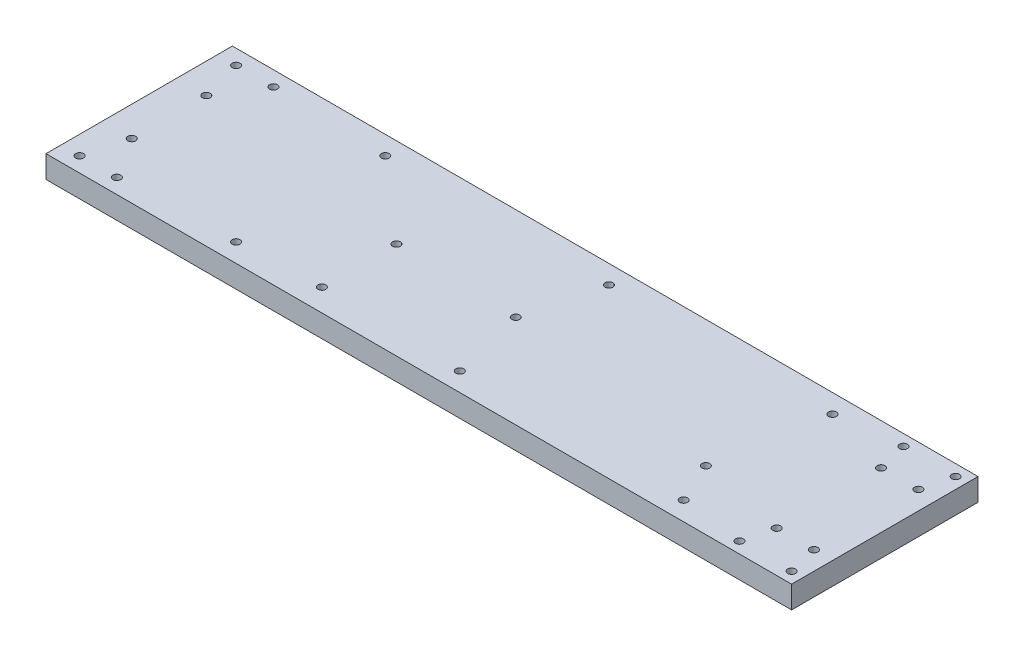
ISO-10303-21;
HEADER;
FILE_DESCRIPTION(('STEP AP214'),'2;1');
FILE_NAME('part.step','',(''),(''),'','','');
FILE_SCHEMA(('AUTOMOTIVE_DESIGN { 1 0 10303 214 1 1 1 1 }'));
ENDSEC;
DATA;
#1=APPLICATION_CONTEXT('core data for automotive mechanical design processes');
#2=APPLICATION_PROTOCOL_DEFINITION('international standard','automotive_design',2000,#1);
#3=PRODUCT_CONTEXT('',#1,'mechanical');
#4=PRODUCT('Part','Part','',(#3));
#5=PRODUCT_RELATED_PRODUCT_CATEGORY('part','',(#4));
#6=PRODUCT_DEFINITION_FORMATION('','',#4);
#7=PRODUCT_DEFINITION_CONTEXT('part definition',#1,'design');
#8=PRODUCT_DEFINITION('design','',#6,#7);
#9=PRODUCT_DEFINITION_SHAPE('','',#8);
#10=(LENGTH_UNIT() NAMED_UNIT(*) SI_UNIT(.MILLI.,.METRE.));
#11=(NAMED_UNIT(*) PLANE_ANGLE_UNIT() SI_UNIT($,.RADIAN.));
#12=(NAMED_UNIT(*) SI_UNIT($,.STERADIAN.) SOLID_ANGLE_UNIT());
#13=UNCERTAINTY_MEASURE_WITH_UNIT(LENGTH_MEASURE(1.E-05),#10,'distance_accuracy_value','');
#14=(GEOMETRIC_REPRESENTATION_CONTEXT(3) GLOBAL_UNCERTAINTY_ASSIGNED_CONTEXT((#13)) GLOBAL_UNIT_ASSIGNED_CONTEXT((#10,
#11,#12)) REPRESENTATION_CONTEXT('',''));
#15=CARTESIAN_POINT('',(0.,0.,0.));
#16=DIRECTION('',(0.,0.,1.));
#17=DIRECTION('',(1.,0.,0.));
#18=AXIS2_PLACEMENT_3D('',#15,#16,#17);
#19=CARTESIAN_POINT('',(200.,-6.,25.));
#20=DIRECTION('',(1.,0.,0.));
#21=DIRECTION('',(0.,0.,-1.));
#22=AXIS2_PLACEMENT_3D('',#19,#20,#21);
#23=PLANE('',#22);
#24=DIRECTION('',(0.,0.,-1.));
#25=VECTOR('',#24,1.);
#26=CARTESIAN_POINT('',(200.,0.,25.));
#27=LINE('',#26,#25);
#28=CARTESIAN_POINT('',(200.,0.,25.));
#29=VERTEX_POINT('',#28);
#30=CARTESIAN_POINT('',(200.,0.,-25.));
#31=VERTEX_POINT('',#30);
#32=EDGE_CURVE('E66',#29,#31,#27,.T.);
#33=ORIENTED_EDGE('',*,*,#32,.F.);
#34=DIRECTION('',(0.,1.,0.));
#35=VECTOR('',#34,1.);
#36=CARTESIAN_POINT('',(200.,-6.,25.));
#37=LINE('',#36,#35);
#38=CARTESIAN_POINT('',(200.,-6.,25.));
#39=VERTEX_POINT('',#38);
#40=EDGE_CURVE('E11',#39,#29,#37,.T.);
#41=ORIENTED_EDGE('',*,*,#40,.F.);
#42=DIRECTION('',(0.,0.,-1.));
#43=VECTOR('',#42,1.);
#44=CARTESIAN_POINT('',(200.,-6.,25.));
#45=LINE('',#44,#43);
#46=CARTESIAN_POINT('',(200.,-6.,-25.));
#47=VERTEX_POINT('',#46);
#48=EDGE_CURVE('E68',#39,#47,#45,.T.);
#49=ORIENTED_EDGE('',*,*,#48,.T.);
#50=DIRECTION('',(0.,1.,0.));
#51=VECTOR('',#50,1.);
#52=CARTESIAN_POINT('',(200.,-6.,-25.));
#53=LINE('',#52,#51);
#54=EDGE_CURVE('E29',#47,#31,#53,.T.);
#55=ORIENTED_EDGE('',*,*,#54,.T.);
#56=EDGE_LOOP('',(#33,#41,#49,#55));
#57=FACE_BOUND('',#56,.T.);
#58=ADVANCED_FACE('F26',(#57),#23,.T.);
#59=CARTESIAN_POINT('',(200.,-6.,25.));
#60=DIRECTION('',(0.,0.,1.));
#61=DIRECTION('',(1.,0.,0.));
#62=AXIS2_PLACEMENT_3D('',#59,#60,#61);
#63=PLANE('',#62);
#64=DIRECTION('',(1.,0.,0.));
#65=VECTOR('',#64,1.);
#66=CARTESIAN_POINT('',(200.,0.,25.));
#67=LINE('',#66,#65);
#68=CARTESIAN_POINT('',(0.,0.,25.));
#69=VERTEX_POINT('',#68);
#70=EDGE_CURVE('E83',#69,#29,#67,.T.);
#71=ORIENTED_EDGE('',*,*,#70,.F.);
#72=DIRECTION('',(0.,1.,0.));
#73=VECTOR('',#72,1.);
#74=CARTESIAN_POINT('',(0.,-6.,25.));
#75=LINE('',#74,#73);
#76=CARTESIAN_POINT('',(0.,-6.,25.));
#77=VERTEX_POINT('',#76);
#78=EDGE_CURVE('E34',#77,#69,#75,.T.);
#79=ORIENTED_EDGE('',*,*,#78,.F.);
#80=DIRECTION('',(1.,0.,0.));
#81=VECTOR('',#80,1.);
#82=CARTESIAN_POINT('',(200.,-6.,25.));
#83=LINE('',#82,#81);
#84=EDGE_CURVE('E73',#77,#39,#83,.T.);
#85=ORIENTED_EDGE('',*,*,#84,.T.);
#86=ORIENTED_EDGE('',*,*,#40,.T.);
#87=EDGE_LOOP('',(#71,#79,#85,#86));
#88=FACE_BOUND('',#87,.T.);
#89=ADVANCED_FACE('F103',(#88),#63,.T.);
#90=CARTESIAN_POINT('',(0.,-6.,25.));
#91=DIRECTION('',(-1.,0.,0.));
#92=DIRECTION('',(0.,0.,1.));
#93=AXIS2_PLACEMENT_3D('',#90,#91,#92);
#94=PLANE('',#93);
#95=DIRECTION('',(0.,0.,1.));
#96=VECTOR('',#95,1.);
#97=CARTESIAN_POINT('',(0.,0.,25.));
#98=LINE('',#97,#96);
#99=CARTESIAN_POINT('',(0.,0.,-25.));
#100=VERTEX_POINT('',#99);
#101=EDGE_CURVE('E80',#100,#69,#98,.T.);
#102=ORIENTED_EDGE('',*,*,#101,.F.);
#103=DIRECTION('',(0.,1.,0.));
#104=VECTOR('',#103,1.);
#105=CARTESIAN_POINT('',(0.,-6.,-25.));
#106=LINE('',#105,#104);
#107=CARTESIAN_POINT('',(0.,-6.,-25.));
#108=VERTEX_POINT('',#107);
#109=EDGE_CURVE('E72',#108,#100,#106,.T.);
#110=ORIENTED_EDGE('',*,*,#109,.F.);
#111=DIRECTION('',(0.,0.,1.));
#112=VECTOR('',#111,1.);
#113=CARTESIAN_POINT('',(0.,-6.,25.));
#114=LINE('',#113,#112);
#115=EDGE_CURVE('E96',#108,#77,#114,.T.);
#116=ORIENTED_EDGE('',*,*,#115,.T.);
#117=ORIENTED_EDGE('',*,*,#78,.T.);
#118=EDGE_LOOP('',(#102,#110,#116,#117));
#119=FACE_BOUND('',#118,.T.);
#120=ADVANCED_FACE('F100',(#119),#94,.T.);
#121=CARTESIAN_POINT('',(200.,-6.,-25.));
#122=DIRECTION('',(0.,0.,-1.));
#123=DIRECTION('',(-1.,0.,0.));
#124=AXIS2_PLACEMENT_3D('',#121,#122,#123);
#125=PLANE('',#124);
#126=DIRECTION('',(-1.,0.,0.));
#127=VECTOR('',#126,1.);
#128=CARTESIAN_POINT('',(200.,0.,-25.));
#129=LINE('',#128,#127);
#130=EDGE_CURVE('E75',#31,#100,#129,.T.);
#131=ORIENTED_EDGE('',*,*,#130,.F.);
#132=ORIENTED_EDGE('',*,*,#54,.F.);
#133=DIRECTION('',(-1.,0.,0.));
#134=VECTOR('',#133,1.);
#135=CARTESIAN_POINT('',(200.,-6.,-25.));
#136=LINE('',#135,#134);
#137=EDGE_CURVE('E94',#47,#108,#136,.T.);
#138=ORIENTED_EDGE('',*,*,#137,.T.);
#139=ORIENTED_EDGE('',*,*,#109,.T.);
#140=EDGE_LOOP('',(#131,#132,#138,#139));
#141=FACE_BOUND('',#140,.T.);
#142=ADVANCED_FACE('F76',(#141),#125,.T.);
#143=CARTESIAN_POINT('',(200.,-6.,-25.));
#144=DIRECTION('',(0.,1.,0.));
#145=DIRECTION('',(0.,0.,1.));
#146=AXIS2_PLACEMENT_3D('',#143,#144,#145);
#147=PLANE('',#146);
#148=ORIENTED_EDGE('',*,*,#48,.F.);
#149=ORIENTED_EDGE('',*,*,#84,.F.);
#150=ORIENTED_EDGE('',*,*,#115,.F.);
#151=ORIENTED_EDGE('',*,*,#137,.F.);
#152=EDGE_LOOP('',(#148,#149,#150,#151));
#153=FACE_BOUND('',#152,.T.);
#154=ADVANCED_FACE('F105',(#153),#147,.F.);
#155=CARTESIAN_POINT('',(200.,0.,-25.));
#156=DIRECTION('',(0.,1.,0.));
#157=DIRECTION('',(0.,0.,1.));
#158=AXIS2_PLACEMENT_3D('',#155,#156,#157);
#159=PLANE('',#158);
#160=CARTESIAN_POINT('',(68.,0.,-1.00000000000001));
#161=DIRECTION('',(0.,1.,0.));
#162=DIRECTION('',(1.,0.,0.));
#163=AXIS2_PLACEMENT_3D('',#160,#161,#162);
#164=CIRCLE('',#163,1.04999999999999);
#165=CARTESIAN_POINT('',(69.05,0.,-1.00000000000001));
#166=VERTEX_POINT('',#165);
#167=EDGE_CURVE('E525',#166,#166,#164,.T.);
#168=ORIENTED_EDGE('',*,*,#167,.F.);
#169=EDGE_LOOP('',(#168));
#170=FACE_BOUND('',#169,.T.);
#171=CARTESIAN_POINT('',(161.,0.,8.99999999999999));
#172=DIRECTION('',(0.,1.,0.));
#173=DIRECTION('',(-1.,0.,0.));
#174=AXIS2_PLACEMENT_3D('',#171,#172,#173);
#175=CIRCLE('',#174,1.04999999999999);
#176=CARTESIAN_POINT('',(159.95,0.,8.99999999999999));
#177=VERTEX_POINT('',#176);
#178=EDGE_CURVE('E524',#177,#177,#175,.T.);
#179=ORIENTED_EDGE('',*,*,#178,.F.);
#180=EDGE_LOOP('',(#179));
#181=FACE_BOUND('',#180,.T.);
#182=CARTESIAN_POINT('',(68.,0.,19.));
#183=DIRECTION('',(0.,1.,0.));
#184=DIRECTION('',(-1.,0.,0.));
#185=AXIS2_PLACEMENT_3D('',#182,#183,#184);
#186=CIRCLE('',#185,1.04999999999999);
#187=CARTESIAN_POINT('',(66.95,0.,19.));
#188=VERTEX_POINT('',#187);
#189=EDGE_CURVE('E535',#188,#188,#186,.T.);
#190=ORIENTED_EDGE('',*,*,#189,.F.);
#191=EDGE_LOOP('',(#190));
#192=FACE_BOUND('',#191,.T.);
#193=CARTESIAN_POINT('',(8.,0.,-10.));
#194=DIRECTION('',(0.,1.,0.));
#195=DIRECTION('',(1.,0.,0.));
#196=AXIS2_PLACEMENT_3D('',#193,#194,#195);
#197=CIRCLE('',#196,1.05);
#198=CARTESIAN_POINT('',(9.05,0.,-10.));
#199=VERTEX_POINT('',#198);
#200=EDGE_CURVE('E541',#199,#199,#197,.T.);
#201=ORIENTED_EDGE('',*,*,#200,.F.);
#202=EDGE_LOOP('',(#201));
#203=FACE_BOUND('',#202,.T.);
#204=CARTESIAN_POINT('',(101.,0.,0.));
#205=DIRECTION('',(0.,1.,0.));
#206=DIRECTION('',(-1.,0.,0.));
#207=AXIS2_PLACEMENT_3D('',#204,#205,#206);
#208=CIRCLE('',#207,1.04999999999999);
#209=CARTESIAN_POINT('',(99.95,0.,0.));
#210=VERTEX_POINT('',#209);
#211=EDGE_CURVE('E547',#210,#210,#208,.T.);
#212=ORIENTED_EDGE('',*,*,#211,.F.);
#213=EDGE_LOOP('',(#212));
#214=FACE_BOUND('',#213,.T.);
#215=CARTESIAN_POINT('',(8.,0.,10.));
#216=DIRECTION('',(0.,1.,0.));
#217=DIRECTION('',(-1.,0.,0.));
#218=AXIS2_PLACEMENT_3D('',#215,#216,#217);
#219=CIRCLE('',#218,1.05);
#220=CARTESIAN_POINT('',(6.95,0.,10.));
#221=VERTEX_POINT('',#220);
#222=EDGE_CURVE('E553',#221,#221,#219,.T.);
#223=ORIENTED_EDGE('',*,*,#222,.F.);
#224=EDGE_LOOP('',(#223));
#225=FACE_BOUND('',#224,.T.);
#226=CARTESIAN_POINT('',(185.,0.,-14.));
#227=DIRECTION('',(0.,1.,0.));
#228=DIRECTION('',(1.,0.,0.));
#229=AXIS2_PLACEMENT_3D('',#226,#227,#228);
#230=CIRCLE('',#229,1.04999999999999);
#231=CARTESIAN_POINT('',(186.05,0.,-14.));
#232=VERTEX_POINT('',#231);
#233=EDGE_CURVE('E559',#232,#232,#230,.T.);
#234=ORIENTED_EDGE('',*,*,#233,.F.);
#235=EDGE_LOOP('',(#234));
#236=FACE_BOUND('',#235,.T.);
#237=CARTESIAN_POINT('',(195.,0.,-14.));
#238=DIRECTION('',(0.,1.,0.));
#239=DIRECTION('',(1.,0.,0.));
#240=AXIS2_PLACEMENT_3D('',#237,#238,#239);
#241=CIRCLE('',#240,1.04999999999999);
#242=CARTESIAN_POINT('',(196.05,0.,-14.));
#243=VERTEX_POINT('',#242);
#244=EDGE_CURVE('E565',#243,#243,#241,.T.);
#245=ORIENTED_EDGE('',*,*,#244,.F.);
#246=EDGE_LOOP('',(#245));
#247=FACE_BOUND('',#246,.T.);
#248=CARTESIAN_POINT('',(185.,0.,14.));
#249=DIRECTION('',(0.,1.,0.));
#250=DIRECTION('',(-1.,0.,0.));
#251=AXIS2_PLACEMENT_3D('',#248,#249,#250);
#252=CIRCLE('',#251,1.05);
#253=CARTESIAN_POINT('',(183.95,0.,14.));
#254=VERTEX_POINT('',#253);
#255=EDGE_CURVE('E571',#254,#254,#252,.T.);
#256=ORIENTED_EDGE('',*,*,#255,.F.);
#257=EDGE_LOOP('',(#256));
#258=FACE_BOUND('',#257,.T.);
#259=CARTESIAN_POINT('',(195.,0.,14.));
#260=DIRECTION('',(0.,1.,0.));
#261=DIRECTION('',(-1.,0.,0.));
#262=AXIS2_PLACEMENT_3D('',#259,#260,#261);
#263=CIRCLE('',#262,1.04999999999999);
#264=CARTESIAN_POINT('',(193.95,0.,14.));
#265=VERTEX_POINT('',#264);
#266=EDGE_CURVE('E577',#265,#265,#263,.T.);
#267=ORIENTED_EDGE('',*,*,#266,.F.);
#268=EDGE_LOOP('',(#267));
#269=FACE_BOUND('',#268,.T.);
#270=CARTESIAN_POINT('',(183.,0.,-22.));
#271=DIRECTION('',(0.,1.,0.));
#272=DIRECTION('',(1.,0.,0.));
#273=AXIS2_PLACEMENT_3D('',#270,#271,#272);
#274=CIRCLE('',#273,1.04999999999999);
#275=CARTESIAN_POINT('',(184.05,0.,-22.));
#276=VERTEX_POINT('',#275);
#277=EDGE_CURVE('E583',#276,#276,#274,.T.);
#278=ORIENTED_EDGE('',*,*,#277,.F.);
#279=EDGE_LOOP('',(#278));
#280=FACE_BOUND('',#279,.T.);
#281=CARTESIAN_POINT('',(197.,0.,-22.));
#282=DIRECTION('',(0.,1.,0.));
#283=DIRECTION('',(1.,0.,0.));
#284=AXIS2_PLACEMENT_3D('',#281,#282,#283);
#285=CIRCLE('',#284,1.04999999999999);
#286=CARTESIAN_POINT('',(198.05,0.,-22.));
#287=VERTEX_POINT('',#286);
#288=EDGE_CURVE('E589',#287,#287,#285,.T.);
#289=ORIENTED_EDGE('',*,*,#288,.F.);
#290=EDGE_LOOP('',(#289));
#291=FACE_BOUND('',#290,.T.);
#292=CARTESIAN_POINT('',(166.,0.,-19.95));
#293=DIRECTION('',(0.,1.,0.));
#294=DIRECTION('',(1.,0.,0.));
#295=AXIS2_PLACEMENT_3D('',#292,#293,#294);
#296=CIRCLE('',#295,1.04999999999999);
#297=CARTESIAN_POINT('',(167.05,0.,-19.95));
#298=VERTEX_POINT('',#297);
#299=EDGE_CURVE('E595',#298,#298,#296,.T.);
#300=ORIENTED_EDGE('',*,*,#299,.F.);
#301=EDGE_LOOP('',(#300));
#302=FACE_BOUND('',#301,.T.);
#303=CARTESIAN_POINT('',(106.,0.,-20.));
#304=DIRECTION('',(0.,1.,0.));
#305=DIRECTION('',(1.,0.,0.));
#306=AXIS2_PLACEMENT_3D('',#303,#304,#305);
#307=CIRCLE('',#306,1.04999999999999);
#308=CARTESIAN_POINT('',(107.05,0.,-20.));
#309=VERTEX_POINT('',#308);
#310=EDGE_CURVE('E601',#309,#309,#307,.T.);
#311=ORIENTED_EDGE('',*,*,#310,.F.);
#312=EDGE_LOOP('',(#311));
#313=FACE_BOUND('',#312,.T.);
#314=CARTESIAN_POINT('',(46.,0.,-20.));
#315=DIRECTION('',(0.,1.,0.));
#316=DIRECTION('',(1.,0.,0.));
#317=AXIS2_PLACEMENT_3D('',#314,#315,#316);
#318=CIRCLE('',#317,1.04999999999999);
#319=CARTESIAN_POINT('',(47.05,0.,-20.));
#320=VERTEX_POINT('',#319);
#321=EDGE_CURVE('E607',#320,#320,#318,.T.);
#322=ORIENTED_EDGE('',*,*,#321,.F.);
#323=EDGE_LOOP('',(#322));
#324=FACE_BOUND('',#323,.T.);
#325=CARTESIAN_POINT('',(15.,0.,-21.));
#326=DIRECTION('',(0.,1.,0.));
#327=DIRECTION('',(1.,0.,0.));
#328=AXIS2_PLACEMENT_3D('',#325,#326,#327);
#329=CIRCLE('',#328,1.05);
#330=CARTESIAN_POINT('',(16.05,0.,-21.));
#331=VERTEX_POINT('',#330);
#332=EDGE_CURVE('E613',#331,#331,#329,.T.);
#333=ORIENTED_EDGE('',*,*,#332,.F.);
#334=EDGE_LOOP('',(#333));
#335=FACE_BOUND('',#334,.T.);
#336=CARTESIAN_POINT('',(5.,0.,-21.));
#337=DIRECTION('',(0.,1.,0.));
#338=DIRECTION('',(1.,0.,0.));
#339=AXIS2_PLACEMENT_3D('',#336,#337,#338);
#340=CIRCLE('',#339,1.05);
#341=CARTESIAN_POINT('',(6.05,0.,-21.));
#342=VERTEX_POINT('',#341);
#343=EDGE_CURVE('E619',#342,#342,#340,.T.);
#344=ORIENTED_EDGE('',*,*,#343,.F.);
#345=EDGE_LOOP('',(#344));
#346=FACE_BOUND('',#345,.T.);
#347=CARTESIAN_POINT('',(183.,0.,22.));
#348=DIRECTION('',(0.,1.,0.));
#349=DIRECTION('',(-1.,0.,0.));
#350=AXIS2_PLACEMENT_3D('',#347,#348,#349);
#351=CIRCLE('',#350,1.04999999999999);
#352=CARTESIAN_POINT('',(181.95,0.,22.));
#353=VERTEX_POINT('',#352);
#354=EDGE_CURVE('E625',#353,#353,#351,.T.);
#355=ORIENTED_EDGE('',*,*,#354,.F.);
#356=EDGE_LOOP('',(#355));
#357=FACE_BOUND('',#356,.T.);
#358=CARTESIAN_POINT('',(197.,0.,22.));
#359=DIRECTION('',(0.,1.,0.));
#360=DIRECTION('',(-1.,0.,0.));
#361=AXIS2_PLACEMENT_3D('',#358,#359,#360);
#362=CIRCLE('',#361,1.04999999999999);
#363=CARTESIAN_POINT('',(195.95,0.,22.));
#364=VERTEX_POINT('',#363);
#365=EDGE_CURVE('E631',#364,#364,#362,.T.);
#366=ORIENTED_EDGE('',*,*,#365,.F.);
#367=EDGE_LOOP('',(#366));
#368=FACE_BOUND('',#367,.T.);
#369=CARTESIAN_POINT('',(15.,0.,21.));
#370=DIRECTION('',(0.,1.,0.));
#371=DIRECTION('',(-1.,0.,0.));
#372=AXIS2_PLACEMENT_3D('',#369,#370,#371);
#373=CIRCLE('',#372,1.05);
#374=CARTESIAN_POINT('',(13.95,0.,21.));
#375=VERTEX_POINT('',#374);
#376=EDGE_CURVE('E637',#375,#375,#373,.T.);
#377=ORIENTED_EDGE('',*,*,#376,.F.);
#378=EDGE_LOOP('',(#377));
#379=FACE_BOUND('',#378,.T.);
#380=CARTESIAN_POINT('',(5.,0.,21.));
#381=DIRECTION('',(0.,1.,0.));
#382=DIRECTION('',(-1.,0.,0.));
#383=AXIS2_PLACEMENT_3D('',#380,#381,#382);
#384=CIRCLE('',#383,1.05);
#385=CARTESIAN_POINT('',(3.95,0.,21.));
#386=VERTEX_POINT('',#385);
#387=EDGE_CURVE('E643',#386,#386,#384,.T.);
#388=ORIENTED_EDGE('',*,*,#387,.F.);
#389=EDGE_LOOP('',(#388));
#390=FACE_BOUND('',#389,.T.);
#391=CARTESIAN_POINT('',(46.,0.,20.));
#392=DIRECTION('',(0.,1.,0.));
#393=DIRECTION('',(-1.,0.,0.));
#394=AXIS2_PLACEMENT_3D('',#391,#392,#393);
#395=CIRCLE('',#394,1.04999999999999);
#396=CARTESIAN_POINT('',(44.95,0.,20.));
#397=VERTEX_POINT('',#396);
#398=EDGE_CURVE('E649',#397,#397,#395,.T.);
#399=ORIENTED_EDGE('',*,*,#398,.F.);
#400=EDGE_LOOP('',(#399));
#401=FACE_BOUND('',#400,.T.);
#402=CARTESIAN_POINT('',(106.,0.,20.));
#403=DIRECTION('',(0.,1.,0.));
#404=DIRECTION('',(-1.,0.,0.));
#405=AXIS2_PLACEMENT_3D('',#402,#403,#404);
#406=CIRCLE('',#405,1.04999999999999);
#407=CARTESIAN_POINT('',(104.95,0.,20.));
#408=VERTEX_POINT('',#407);
#409=EDGE_CURVE('E655',#408,#408,#406,.T.);
#410=ORIENTED_EDGE('',*,*,#409,.F.);
#411=EDGE_LOOP('',(#410));
#412=FACE_BOUND('',#411,.T.);
#413=CARTESIAN_POINT('',(166.,0.,19.95));
#414=DIRECTION('',(0.,1.,0.));
#415=DIRECTION('',(-1.,0.,0.));
#416=AXIS2_PLACEMENT_3D('',#413,#414,#415);
#417=CIRCLE('',#416,1.04999999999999);
#418=CARTESIAN_POINT('',(164.95,0.,19.95));
#419=VERTEX_POINT('',#418);
#420=EDGE_CURVE('E87',#419,#419,#417,.T.);
#421=ORIENTED_EDGE('',*,*,#420,.F.);
#422=EDGE_LOOP('',(#421));
#423=FACE_BOUND('',#422,.T.);
#424=ORIENTED_EDGE('',*,*,#32,.T.);
#425=ORIENTED_EDGE('',*,*,#130,.T.);
#426=ORIENTED_EDGE('',*,*,#101,.T.);
#427=ORIENTED_EDGE('',*,*,#70,.T.);
#428=EDGE_LOOP('',(#424,#425,#426,#427));
#429=FACE_BOUND('',#428,.T.);
#430=ADVANCED_FACE('F82',(#170,#181,#192,#203,#214,#225,#236,#247,#258,#269,#280,#291,#302,#313,
#324,#335,#346,#357,#368,#379,#390,#401,#412,#423,#429),#159,.T.);
#431=CARTESIAN_POINT('',(166.,-2.00000000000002,19.95));
#432=DIRECTION('',(0.,1.,0.));
#433=DIRECTION('',(-1.,0.,0.));
#434=AXIS2_PLACEMENT_3D('',#431,#432,#433);
#435=CYLINDRICAL_SURFACE('',#434,1.04999999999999);
#436=CARTESIAN_POINT('',(166.,-2.00000000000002,19.95));
#437=DIRECTION('',(0.,1.,0.));
#438=DIRECTION('',(-1.,0.,0.));
#439=AXIS2_PLACEMENT_3D('',#436,#437,#438);
#440=CIRCLE('',#439,1.04999999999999);
#441=CARTESIAN_POINT('',(164.95,-2.00000000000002,19.95));
#442=VERTEX_POINT('',#441);
#443=EDGE_CURVE('E84',#442,#442,#440,.T.);
#444=ORIENTED_EDGE('',*,*,#443,.F.);
#445=EDGE_LOOP('',(#444));
#446=FACE_BOUND('',#445,.T.);
#447=ORIENTED_EDGE('',*,*,#420,.T.);
#448=EDGE_LOOP('',(#447));
#449=FACE_BOUND('',#448,.T.);
#450=ADVANCED_FACE('F112',(#446,#449),#435,.F.);
#451=CARTESIAN_POINT('',(166.,-2.00000000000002,19.95));
#452=DIRECTION('',(0.,1.,0.));
#453=DIRECTION('',(-1.,0.,0.));
#454=AXIS2_PLACEMENT_3D('',#451,#452,#453);
#455=PLANE('',#454);
#456=ORIENTED_EDGE('',*,*,#443,.T.);
#457=EDGE_LOOP('',(#456));
#458=FACE_BOUND('',#457,.T.);
#459=ADVANCED_FACE('F143',(#458),#455,.T.);
#460=CARTESIAN_POINT('',(106.,-2.00000000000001,20.));
#461=DIRECTION('',(0.,1.,0.));
#462=DIRECTION('',(-1.,0.,0.));
#463=AXIS2_PLACEMENT_3D('',#460,#461,#462);
#464=CYLINDRICAL_SURFACE('',#463,1.04999999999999);
#465=CARTESIAN_POINT('',(106.,-2.00000000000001,20.));
#466=DIRECTION('',(0.,1.,0.));
#467=DIRECTION('',(-1.,0.,0.));
#468=AXIS2_PLACEMENT_3D('',#465,#466,#467);
#469=CIRCLE('',#468,1.04999999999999);
#470=CARTESIAN_POINT('',(104.95,-2.00000000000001,20.));
#471=VERTEX_POINT('',#470);
#472=EDGE_CURVE('E658',#471,#471,#469,.T.);
#473=ORIENTED_EDGE('',*,*,#472,.F.);
#474=EDGE_LOOP('',(#473));
#475=FACE_BOUND('',#474,.T.);
#476=ORIENTED_EDGE('',*,*,#409,.T.);
#477=EDGE_LOOP('',(#476));
#478=FACE_BOUND('',#477,.T.);
#479=ADVANCED_FACE('F151',(#475,#478),#464,.F.);
#480=CARTESIAN_POINT('',(106.,-2.00000000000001,20.));
#481=DIRECTION('',(0.,1.,0.));
#482=DIRECTION('',(-1.,0.,0.));
#483=AXIS2_PLACEMENT_3D('',#480,#481,#482);
#484=PLANE('',#483);
#485=ORIENTED_EDGE('',*,*,#472,.T.);
#486=EDGE_LOOP('',(#485));
#487=FACE_BOUND('',#486,.T.);
#488=ADVANCED_FACE('F159',(#487),#484,.T.);
#489=CARTESIAN_POINT('',(46.,-2.,20.));
#490=DIRECTION('',(0.,1.,0.));
#491=DIRECTION('',(-1.,0.,0.));
#492=AXIS2_PLACEMENT_3D('',#489,#490,#491);
#493=CYLINDRICAL_SURFACE('',#492,1.04999999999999);
#494=CARTESIAN_POINT('',(46.,-2.,20.));
#495=DIRECTION('',(0.,1.,0.));
#496=DIRECTION('',(-1.,0.,0.));
#497=AXIS2_PLACEMENT_3D('',#494,#495,#496);
#498=CIRCLE('',#497,1.04999999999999);
#499=CARTESIAN_POINT('',(44.95,-2.,20.));
#500=VERTEX_POINT('',#499);
#501=EDGE_CURVE('E652',#500,#500,#498,.T.);
#502=ORIENTED_EDGE('',*,*,#501,.F.);
#503=EDGE_LOOP('',(#502));
#504=FACE_BOUND('',#503,.T.);
#505=ORIENTED_EDGE('',*,*,#398,.T.);
#506=EDGE_LOOP('',(#505));
#507=FACE_BOUND('',#506,.T.);
#508=ADVANCED_FACE('F167',(#504,#507),#493,.F.);
#509=CARTESIAN_POINT('',(46.,-2.,20.));
#510=DIRECTION('',(0.,1.,0.));
#511=DIRECTION('',(-1.,0.,0.));
#512=AXIS2_PLACEMENT_3D('',#509,#510,#511);
#513=PLANE('',#512);
#514=ORIENTED_EDGE('',*,*,#501,.T.);
#515=EDGE_LOOP('',(#514));
#516=FACE_BOUND('',#515,.T.);
#517=ADVANCED_FACE('F175',(#516),#513,.T.);
#518=CARTESIAN_POINT('',(5.,-2.,21.));
#519=DIRECTION('',(0.,1.,0.));
#520=DIRECTION('',(-1.,0.,0.));
#521=AXIS2_PLACEMENT_3D('',#518,#519,#520);
#522=CYLINDRICAL_SURFACE('',#521,1.05);
#523=CARTESIAN_POINT('',(5.,-2.,21.));
#524=DIRECTION('',(0.,1.,0.));
#525=DIRECTION('',(-1.,0.,0.));
#526=AXIS2_PLACEMENT_3D('',#523,#524,#525);
#527=CIRCLE('',#526,1.05);
#528=CARTESIAN_POINT('',(3.95,-2.,21.));
#529=VERTEX_POINT('',#528);
#530=EDGE_CURVE('E646',#529,#529,#527,.T.);
#531=ORIENTED_EDGE('',*,*,#530,.F.);
#532=EDGE_LOOP('',(#531));
#533=FACE_BOUND('',#532,.T.);
#534=ORIENTED_EDGE('',*,*,#387,.T.);
#535=EDGE_LOOP('',(#534));
#536=FACE_BOUND('',#535,.T.);
#537=ADVANCED_FACE('F183',(#533,#536),#522,.F.);
#538=CARTESIAN_POINT('',(5.,-2.,21.));
#539=DIRECTION('',(0.,1.,0.));
#540=DIRECTION('',(-1.,0.,0.));
#541=AXIS2_PLACEMENT_3D('',#538,#539,#540);
#542=PLANE('',#541);
#543=ORIENTED_EDGE('',*,*,#530,.T.);
#544=EDGE_LOOP('',(#543));
#545=FACE_BOUND('',#544,.T.);
#546=ADVANCED_FACE('F191',(#545),#542,.T.);
#547=CARTESIAN_POINT('',(15.,-2.,21.));
#548=DIRECTION('',(0.,1.,0.));
#549=DIRECTION('',(-1.,0.,0.));
#550=AXIS2_PLACEMENT_3D('',#547,#548,#549);
#551=CYLINDRICAL_SURFACE('',#550,1.05);
#552=CARTESIAN_POINT('',(15.,-2.,21.));
#553=DIRECTION('',(0.,1.,0.));
#554=DIRECTION('',(-1.,0.,0.));
#555=AXIS2_PLACEMENT_3D('',#552,#553,#554);
#556=CIRCLE('',#555,1.05);
#557=CARTESIAN_POINT('',(13.95,-2.,21.));
#558=VERTEX_POINT('',#557);
#559=EDGE_CURVE('E640',#558,#558,#556,.T.);
#560=ORIENTED_EDGE('',*,*,#559,.F.);
#561=EDGE_LOOP('',(#560));
#562=FACE_BOUND('',#561,.T.);
#563=ORIENTED_EDGE('',*,*,#376,.T.);
#564=EDGE_LOOP('',(#563));
#565=FACE_BOUND('',#564,.T.);
#566=ADVANCED_FACE('F199',(#562,#565),#551,.F.);
#567=CARTESIAN_POINT('',(15.,-2.,21.));
#568=DIRECTION('',(0.,1.,0.));
#569=DIRECTION('',(-1.,0.,0.));
#570=AXIS2_PLACEMENT_3D('',#567,#568,#569);
#571=PLANE('',#570);
#572=ORIENTED_EDGE('',*,*,#559,.T.);
#573=EDGE_LOOP('',(#572));
#574=FACE_BOUND('',#573,.T.);
#575=ADVANCED_FACE('F207',(#574),#571,.T.);
#576=CARTESIAN_POINT('',(197.,-2.00000000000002,22.));
#577=DIRECTION('',(0.,1.,0.));
#578=DIRECTION('',(-1.,0.,0.));
#579=AXIS2_PLACEMENT_3D('',#576,#577,#578);
#580=CYLINDRICAL_SURFACE('',#579,1.04999999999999);
#581=CARTESIAN_POINT('',(197.,-2.00000000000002,22.));
#582=DIRECTION('',(0.,1.,0.));
#583=DIRECTION('',(-1.,0.,0.));
#584=AXIS2_PLACEMENT_3D('',#581,#582,#583);
#585=CIRCLE('',#584,1.04999999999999);
#586=CARTESIAN_POINT('',(195.95,-2.00000000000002,22.));
#587=VERTEX_POINT('',#586);
#588=EDGE_CURVE('E634',#587,#587,#585,.T.);
#589=ORIENTED_EDGE('',*,*,#588,.F.);
#590=EDGE_LOOP('',(#589));
#591=FACE_BOUND('',#590,.T.);
#592=ORIENTED_EDGE('',*,*,#365,.T.);
#593=EDGE_LOOP('',(#592));
#594=FACE_BOUND('',#593,.T.);
#595=ADVANCED_FACE('F215',(#591,#594),#580,.F.);
#596=CARTESIAN_POINT('',(197.,-2.00000000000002,22.));
#597=DIRECTION('',(0.,1.,0.));
#598=DIRECTION('',(-1.,0.,0.));
#599=AXIS2_PLACEMENT_3D('',#596,#597,#598);
#600=PLANE('',#599);
#601=ORIENTED_EDGE('',*,*,#588,.T.);
#602=EDGE_LOOP('',(#601));
#603=FACE_BOUND('',#602,.T.);
#604=ADVANCED_FACE('F223',(#603),#600,.T.);
#605=CARTESIAN_POINT('',(183.,-2.00000000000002,22.));
#606=DIRECTION('',(0.,1.,0.));
#607=DIRECTION('',(-1.,0.,0.));
#608=AXIS2_PLACEMENT_3D('',#605,#606,#607);
#609=CYLINDRICAL_SURFACE('',#608,1.04999999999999);
#610=CARTESIAN_POINT('',(183.,-2.00000000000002,22.));
#611=DIRECTION('',(0.,1.,0.));
#612=DIRECTION('',(-1.,0.,0.));
#613=AXIS2_PLACEMENT_3D('',#610,#611,#612);
#614=CIRCLE('',#613,1.04999999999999);
#615=CARTESIAN_POINT('',(181.95,-2.00000000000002,22.));
#616=VERTEX_POINT('',#615);
#617=EDGE_CURVE('E628',#616,#616,#614,.T.);
#618=ORIENTED_EDGE('',*,*,#617,.F.);
#619=EDGE_LOOP('',(#618));
#620=FACE_BOUND('',#619,.T.);
#621=ORIENTED_EDGE('',*,*,#354,.T.);
#622=EDGE_LOOP('',(#621));
#623=FACE_BOUND('',#622,.T.);
#624=ADVANCED_FACE('F231',(#620,#623),#609,.F.);
#625=CARTESIAN_POINT('',(183.,-2.00000000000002,22.));
#626=DIRECTION('',(0.,1.,0.));
#627=DIRECTION('',(-1.,0.,0.));
#628=AXIS2_PLACEMENT_3D('',#625,#626,#627);
#629=PLANE('',#628);
#630=ORIENTED_EDGE('',*,*,#617,.T.);
#631=EDGE_LOOP('',(#630));
#632=FACE_BOUND('',#631,.T.);
#633=ADVANCED_FACE('F239',(#632),#629,.T.);
#634=CARTESIAN_POINT('',(5.,-2.,-21.));
#635=DIRECTION('',(0.,1.,0.));
#636=DIRECTION('',(-1.,0.,0.));
#637=AXIS2_PLACEMENT_3D('',#634,#635,#636);
#638=CYLINDRICAL_SURFACE('',#637,1.05);
#639=CARTESIAN_POINT('',(5.,-2.,-21.));
#640=DIRECTION('',(0.,1.,0.));
#641=DIRECTION('',(1.,0.,0.));
#642=AXIS2_PLACEMENT_3D('',#639,#640,#641);
#643=CIRCLE('',#642,1.05);
#644=CARTESIAN_POINT('',(6.05,-2.,-21.));
#645=VERTEX_POINT('',#644);
#646=EDGE_CURVE('E622',#645,#645,#643,.T.);
#647=ORIENTED_EDGE('',*,*,#646,.F.);
#648=EDGE_LOOP('',(#647));
#649=FACE_BOUND('',#648,.T.);
#650=ORIENTED_EDGE('',*,*,#343,.T.);
#651=EDGE_LOOP('',(#650));
#652=FACE_BOUND('',#651,.T.);
#653=ADVANCED_FACE('F247',(#649,#652),#638,.F.);
#654=CARTESIAN_POINT('',(5.,-2.,-21.));
#655=DIRECTION('',(0.,-1.,0.));
#656=DIRECTION('',(1.,0.,0.));
#657=AXIS2_PLACEMENT_3D('',#654,#655,#656);
#658=PLANE('',#657);
#659=ORIENTED_EDGE('',*,*,#646,.T.);
#660=EDGE_LOOP('',(#659));
#661=FACE_BOUND('',#660,.T.);
#662=ADVANCED_FACE('F255',(#661),#658,.F.);
#663=CARTESIAN_POINT('',(15.,-2.,-21.));
#664=DIRECTION('',(0.,1.,0.));
#665=DIRECTION('',(-1.,0.,0.));
#666=AXIS2_PLACEMENT_3D('',#663,#664,#665);
#667=CYLINDRICAL_SURFACE('',#666,1.05);
#668=CARTESIAN_POINT('',(15.,-2.,-21.));
#669=DIRECTION('',(0.,1.,0.));
#670=DIRECTION('',(1.,0.,0.));
#671=AXIS2_PLACEMENT_3D('',#668,#669,#670);
#672=CIRCLE('',#671,1.05);
#673=CARTESIAN_POINT('',(16.05,-2.,-21.));
#674=VERTEX_POINT('',#673);
#675=EDGE_CURVE('E616',#674,#674,#672,.T.);
#676=ORIENTED_EDGE('',*,*,#675,.F.);
#677=EDGE_LOOP('',(#676));
#678=FACE_BOUND('',#677,.T.);
#679=ORIENTED_EDGE('',*,*,#332,.T.);
#680=EDGE_LOOP('',(#679));
#681=FACE_BOUND('',#680,.T.);
#682=ADVANCED_FACE('F263',(#678,#681),#667,.F.);
#683=CARTESIAN_POINT('',(15.,-2.,-21.));
#684=DIRECTION('',(0.,-1.,0.));
#685=DIRECTION('',(1.,0.,0.));
#686=AXIS2_PLACEMENT_3D('',#683,#684,#685);
#687=PLANE('',#686);
#688=ORIENTED_EDGE('',*,*,#675,.T.);
#689=EDGE_LOOP('',(#688));
#690=FACE_BOUND('',#689,.T.);
#691=ADVANCED_FACE('F271',(#690),#687,.F.);
#692=CARTESIAN_POINT('',(46.,-2.,-20.));
#693=DIRECTION('',(0.,1.,0.));
#694=DIRECTION('',(-1.,0.,0.));
#695=AXIS2_PLACEMENT_3D('',#692,#693,#694);
#696=CYLINDRICAL_SURFACE('',#695,1.04999999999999);
#697=CARTESIAN_POINT('',(46.,-2.,-20.));
#698=DIRECTION('',(0.,1.,0.));
#699=DIRECTION('',(1.,0.,0.));
#700=AXIS2_PLACEMENT_3D('',#697,#698,#699);
#701=CIRCLE('',#700,1.04999999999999);
#702=CARTESIAN_POINT('',(47.05,-2.,-20.));
#703=VERTEX_POINT('',#702);
#704=EDGE_CURVE('E610',#703,#703,#701,.T.);
#705=ORIENTED_EDGE('',*,*,#704,.F.);
#706=EDGE_LOOP('',(#705));
#707=FACE_BOUND('',#706,.T.);
#708=ORIENTED_EDGE('',*,*,#321,.T.);
#709=EDGE_LOOP('',(#708));
#710=FACE_BOUND('',#709,.T.);
#711=ADVANCED_FACE('F279',(#707,#710),#696,.F.);
#712=CARTESIAN_POINT('',(46.,-2.,-20.));
#713=DIRECTION('',(0.,-1.,0.));
#714=DIRECTION('',(1.,0.,0.));
#715=AXIS2_PLACEMENT_3D('',#712,#713,#714);
#716=PLANE('',#715);
#717=ORIENTED_EDGE('',*,*,#704,.T.);
#718=EDGE_LOOP('',(#717));
#719=FACE_BOUND('',#718,.T.);
#720=ADVANCED_FACE('F287',(#719),#716,.F.);
#721=CARTESIAN_POINT('',(106.,-2.00000000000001,-20.));
#722=DIRECTION('',(0.,1.,0.));
#723=DIRECTION('',(-1.,0.,0.));
#724=AXIS2_PLACEMENT_3D('',#721,#722,#723);
#725=CYLINDRICAL_SURFACE('',#724,1.04999999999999);
#726=CARTESIAN_POINT('',(106.,-2.00000000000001,-20.));
#727=DIRECTION('',(0.,1.,0.));
#728=DIRECTION('',(1.,0.,0.));
#729=AXIS2_PLACEMENT_3D('',#726,#727,#728);
#730=CIRCLE('',#729,1.04999999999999);
#731=CARTESIAN_POINT('',(107.05,-2.00000000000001,-20.));
#732=VERTEX_POINT('',#731);
#733=EDGE_CURVE('E604',#732,#732,#730,.T.);
#734=ORIENTED_EDGE('',*,*,#733,.F.);
#735=EDGE_LOOP('',(#734));
#736=FACE_BOUND('',#735,.T.);
#737=ORIENTED_EDGE('',*,*,#310,.T.);
#738=EDGE_LOOP('',(#737));
#739=FACE_BOUND('',#738,.T.);
#740=ADVANCED_FACE('F295',(#736,#739),#725,.F.);
#741=CARTESIAN_POINT('',(106.,-2.00000000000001,-20.));
#742=DIRECTION('',(0.,-1.,0.));
#743=DIRECTION('',(1.,0.,0.));
#744=AXIS2_PLACEMENT_3D('',#741,#742,#743);
#745=PLANE('',#744);
#746=ORIENTED_EDGE('',*,*,#733,.T.);
#747=EDGE_LOOP('',(#746));
#748=FACE_BOUND('',#747,.T.);
#749=ADVANCED_FACE('F303',(#748),#745,.F.);
#750=CARTESIAN_POINT('',(166.,-2.00000000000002,-19.95));
#751=DIRECTION('',(0.,1.,0.));
#752=DIRECTION('',(-1.,0.,0.));
#753=AXIS2_PLACEMENT_3D('',#750,#751,#752);
#754=CYLINDRICAL_SURFACE('',#753,1.04999999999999);
#755=CARTESIAN_POINT('',(166.,-2.00000000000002,-19.95));
#756=DIRECTION('',(0.,1.,0.));
#757=DIRECTION('',(1.,0.,0.));
#758=AXIS2_PLACEMENT_3D('',#755,#756,#757);
#759=CIRCLE('',#758,1.04999999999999);
#760=CARTESIAN_POINT('',(167.05,-2.00000000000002,-19.95));
#761=VERTEX_POINT('',#760);
#762=EDGE_CURVE('E598',#761,#761,#759,.T.);
#763=ORIENTED_EDGE('',*,*,#762,.F.);
#764=EDGE_LOOP('',(#763));
#765=FACE_BOUND('',#764,.T.);
#766=ORIENTED_EDGE('',*,*,#299,.T.);
#767=EDGE_LOOP('',(#766));
#768=FACE_BOUND('',#767,.T.);
#769=ADVANCED_FACE('F311',(#765,#768),#754,.F.);
#770=CARTESIAN_POINT('',(166.,-2.00000000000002,-19.95));
#771=DIRECTION('',(0.,-1.,0.));
#772=DIRECTION('',(1.,0.,0.));
#773=AXIS2_PLACEMENT_3D('',#770,#771,#772);
#774=PLANE('',#773);
#775=ORIENTED_EDGE('',*,*,#762,.T.);
#776=EDGE_LOOP('',(#775));
#777=FACE_BOUND('',#776,.T.);
#778=ADVANCED_FACE('F319',(#777),#774,.F.);
#779=CARTESIAN_POINT('',(197.,-2.00000000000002,-22.));
#780=DIRECTION('',(0.,1.,0.));
#781=DIRECTION('',(-1.,0.,0.));
#782=AXIS2_PLACEMENT_3D('',#779,#780,#781);
#783=CYLINDRICAL_SURFACE('',#782,1.04999999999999);
#784=CARTESIAN_POINT('',(197.,-2.00000000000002,-22.));
#785=DIRECTION('',(0.,1.,0.));
#786=DIRECTION('',(1.,0.,0.));
#787=AXIS2_PLACEMENT_3D('',#784,#785,#786);
#788=CIRCLE('',#787,1.04999999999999);
#789=CARTESIAN_POINT('',(198.05,-2.00000000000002,-22.));
#790=VERTEX_POINT('',#789);
#791=EDGE_CURVE('E592',#790,#790,#788,.T.);
#792=ORIENTED_EDGE('',*,*,#791,.F.);
#793=EDGE_LOOP('',(#792));
#794=FACE_BOUND('',#793,.T.);
#795=ORIENTED_EDGE('',*,*,#288,.T.);
#796=EDGE_LOOP('',(#795));
#797=FACE_BOUND('',#796,.T.);
#798=ADVANCED_FACE('F327',(#794,#797),#783,.F.);
#799=CARTESIAN_POINT('',(197.,-2.00000000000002,-22.));
#800=DIRECTION('',(0.,-1.,0.));
#801=DIRECTION('',(1.,0.,0.));
#802=AXIS2_PLACEMENT_3D('',#799,#800,#801);
#803=PLANE('',#802);
#804=ORIENTED_EDGE('',*,*,#791,.T.);
#805=EDGE_LOOP('',(#804));
#806=FACE_BOUND('',#805,.T.);
#807=ADVANCED_FACE('F335',(#806),#803,.F.);
#808=CARTESIAN_POINT('',(183.,-2.00000000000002,-22.));
#809=DIRECTION('',(0.,1.,0.));
#810=DIRECTION('',(-1.,0.,0.));
#811=AXIS2_PLACEMENT_3D('',#808,#809,#810);
#812=CYLINDRICAL_SURFACE('',#811,1.04999999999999);
#813=CARTESIAN_POINT('',(183.,-2.00000000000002,-22.));
#814=DIRECTION('',(0.,1.,0.));
#815=DIRECTION('',(1.,0.,0.));
#816=AXIS2_PLACEMENT_3D('',#813,#814,#815);
#817=CIRCLE('',#816,1.04999999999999);
#818=CARTESIAN_POINT('',(184.05,-2.00000000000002,-22.));
#819=VERTEX_POINT('',#818);
#820=EDGE_CURVE('E586',#819,#819,#817,.T.);
#821=ORIENTED_EDGE('',*,*,#820,.F.);
#822=EDGE_LOOP('',(#821));
#823=FACE_BOUND('',#822,.T.);
#824=ORIENTED_EDGE('',*,*,#277,.T.);
#825=EDGE_LOOP('',(#824));
#826=FACE_BOUND('',#825,.T.);
#827=ADVANCED_FACE('F343',(#823,#826),#812,.F.);
#828=CARTESIAN_POINT('',(183.,-2.00000000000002,-22.));
#829=DIRECTION('',(0.,-1.,0.));
#830=DIRECTION('',(1.,0.,0.));
#831=AXIS2_PLACEMENT_3D('',#828,#829,#830);
#832=PLANE('',#831);
#833=ORIENTED_EDGE('',*,*,#820,.T.);
#834=EDGE_LOOP('',(#833));
#835=FACE_BOUND('',#834,.T.);
#836=ADVANCED_FACE('F351',(#835),#832,.F.);
#837=CARTESIAN_POINT('',(195.,-2.00000000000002,14.));
#838=DIRECTION('',(0.,1.,0.));
#839=DIRECTION('',(-1.,0.,0.));
#840=AXIS2_PLACEMENT_3D('',#837,#838,#839);
#841=CYLINDRICAL_SURFACE('',#840,1.04999999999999);
#842=CARTESIAN_POINT('',(195.,-2.00000000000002,14.));
#843=DIRECTION('',(0.,1.,0.));
#844=DIRECTION('',(-1.,0.,0.));
#845=AXIS2_PLACEMENT_3D('',#842,#843,#844);
#846=CIRCLE('',#845,1.04999999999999);
#847=CARTESIAN_POINT('',(193.95,-2.00000000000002,14.));
#848=VERTEX_POINT('',#847);
#849=EDGE_CURVE('E580',#848,#848,#846,.T.);
#850=ORIENTED_EDGE('',*,*,#849,.F.);
#851=EDGE_LOOP('',(#850));
#852=FACE_BOUND('',#851,.T.);
#853=ORIENTED_EDGE('',*,*,#266,.T.);
#854=EDGE_LOOP('',(#853));
#855=FACE_BOUND('',#854,.T.);
#856=ADVANCED_FACE('F359',(#852,#855),#841,.F.);
#857=CARTESIAN_POINT('',(195.,-2.00000000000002,14.));
#858=DIRECTION('',(0.,1.,0.));
#859=DIRECTION('',(-1.,0.,0.));
#860=AXIS2_PLACEMENT_3D('',#857,#858,#859);
#861=PLANE('',#860);
#862=ORIENTED_EDGE('',*,*,#849,.T.);
#863=EDGE_LOOP('',(#862));
#864=FACE_BOUND('',#863,.T.);
#865=ADVANCED_FACE('F367',(#864),#861,.T.);
#866=CARTESIAN_POINT('',(185.,-2.00000000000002,14.));
#867=DIRECTION('',(0.,1.,0.));
#868=DIRECTION('',(-1.,0.,0.));
#869=AXIS2_PLACEMENT_3D('',#866,#867,#868);
#870=CYLINDRICAL_SURFACE('',#869,1.05);
#871=CARTESIAN_POINT('',(185.,-2.00000000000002,14.));
#872=DIRECTION('',(0.,1.,0.));
#873=DIRECTION('',(-1.,0.,0.));
#874=AXIS2_PLACEMENT_3D('',#871,#872,#873);
#875=CIRCLE('',#874,1.05);
#876=CARTESIAN_POINT('',(183.95,-2.00000000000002,14.));
#877=VERTEX_POINT('',#876);
#878=EDGE_CURVE('E574',#877,#877,#875,.T.);
#879=ORIENTED_EDGE('',*,*,#878,.F.);
#880=EDGE_LOOP('',(#879));
#881=FACE_BOUND('',#880,.T.);
#882=ORIENTED_EDGE('',*,*,#255,.T.);
#883=EDGE_LOOP('',(#882));
#884=FACE_BOUND('',#883,.T.);
#885=ADVANCED_FACE('F375',(#881,#884),#870,.F.);
#886=CARTESIAN_POINT('',(185.,-2.00000000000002,14.));
#887=DIRECTION('',(0.,1.,0.));
#888=DIRECTION('',(-1.,0.,0.));
#889=AXIS2_PLACEMENT_3D('',#886,#887,#888);
#890=PLANE('',#889);
#891=ORIENTED_EDGE('',*,*,#878,.T.);
#892=EDGE_LOOP('',(#891));
#893=FACE_BOUND('',#892,.T.);
#894=ADVANCED_FACE('F383',(#893),#890,.T.);
#895=CARTESIAN_POINT('',(195.,-2.00000000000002,-14.));
#896=DIRECTION('',(0.,1.,0.));
#897=DIRECTION('',(-1.,0.,0.));
#898=AXIS2_PLACEMENT_3D('',#895,#896,#897);
#899=CYLINDRICAL_SURFACE('',#898,1.04999999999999);
#900=CARTESIAN_POINT('',(195.,-2.00000000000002,-14.));
#901=DIRECTION('',(0.,1.,0.));
#902=DIRECTION('',(1.,0.,0.));
#903=AXIS2_PLACEMENT_3D('',#900,#901,#902);
#904=CIRCLE('',#903,1.04999999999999);
#905=CARTESIAN_POINT('',(196.05,-2.00000000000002,-14.));
#906=VERTEX_POINT('',#905);
#907=EDGE_CURVE('E568',#906,#906,#904,.T.);
#908=ORIENTED_EDGE('',*,*,#907,.F.);
#909=EDGE_LOOP('',(#908));
#910=FACE_BOUND('',#909,.T.);
#911=ORIENTED_EDGE('',*,*,#244,.T.);
#912=EDGE_LOOP('',(#911));
#913=FACE_BOUND('',#912,.T.);
#914=ADVANCED_FACE('F391',(#910,#913),#899,.F.);
#915=CARTESIAN_POINT('',(195.,-2.00000000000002,-14.));
#916=DIRECTION('',(0.,-1.,0.));
#917=DIRECTION('',(1.,0.,0.));
#918=AXIS2_PLACEMENT_3D('',#915,#916,#917);
#919=PLANE('',#918);
#920=ORIENTED_EDGE('',*,*,#907,.T.);
#921=EDGE_LOOP('',(#920));
#922=FACE_BOUND('',#921,.T.);
#923=ADVANCED_FACE('F399',(#922),#919,.F.);
#924=CARTESIAN_POINT('',(185.,-2.00000000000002,-14.));
#925=DIRECTION('',(0.,1.,0.));
#926=DIRECTION('',(-1.,0.,0.));
#927=AXIS2_PLACEMENT_3D('',#924,#925,#926);
#928=CYLINDRICAL_SURFACE('',#927,1.04999999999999);
#929=CARTESIAN_POINT('',(185.,-2.00000000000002,-14.));
#930=DIRECTION('',(0.,1.,0.));
#931=DIRECTION('',(1.,0.,0.));
#932=AXIS2_PLACEMENT_3D('',#929,#930,#931);
#933=CIRCLE('',#932,1.04999999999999);
#934=CARTESIAN_POINT('',(186.05,-2.00000000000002,-14.));
#935=VERTEX_POINT('',#934);
#936=EDGE_CURVE('E562',#935,#935,#933,.T.);
#937=ORIENTED_EDGE('',*,*,#936,.F.);
#938=EDGE_LOOP('',(#937));
#939=FACE_BOUND('',#938,.T.);
#940=ORIENTED_EDGE('',*,*,#233,.T.);
#941=EDGE_LOOP('',(#940));
#942=FACE_BOUND('',#941,.T.);
#943=ADVANCED_FACE('F407',(#939,#942),#928,.F.);
#944=CARTESIAN_POINT('',(185.,-2.00000000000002,-14.));
#945=DIRECTION('',(0.,-1.,0.));
#946=DIRECTION('',(1.,0.,0.));
#947=AXIS2_PLACEMENT_3D('',#944,#945,#946);
#948=PLANE('',#947);
#949=ORIENTED_EDGE('',*,*,#936,.T.);
#950=EDGE_LOOP('',(#949));
#951=FACE_BOUND('',#950,.T.);
#952=ADVANCED_FACE('F415',(#951),#948,.F.);
#953=CARTESIAN_POINT('',(8.,-2.,10.));
#954=DIRECTION('',(0.,1.,0.));
#955=DIRECTION('',(-1.,0.,0.));
#956=AXIS2_PLACEMENT_3D('',#953,#954,#955);
#957=CYLINDRICAL_SURFACE('',#956,1.05);
#958=CARTESIAN_POINT('',(8.,-2.,10.));
#959=DIRECTION('',(0.,1.,0.));
#960=DIRECTION('',(-1.,0.,0.));
#961=AXIS2_PLACEMENT_3D('',#958,#959,#960);
#962=CIRCLE('',#961,1.05);
#963=CARTESIAN_POINT('',(6.95,-2.,10.));
#964=VERTEX_POINT('',#963);
#965=EDGE_CURVE('E556',#964,#964,#962,.T.);
#966=ORIENTED_EDGE('',*,*,#965,.F.);
#967=EDGE_LOOP('',(#966));
#968=FACE_BOUND('',#967,.T.);
#969=ORIENTED_EDGE('',*,*,#222,.T.);
#970=EDGE_LOOP('',(#969));
#971=FACE_BOUND('',#970,.T.);
#972=ADVANCED_FACE('F423',(#968,#971),#957,.F.);
#973=CARTESIAN_POINT('',(8.,-2.,10.));
#974=DIRECTION('',(0.,1.,0.));
#975=DIRECTION('',(-1.,0.,0.));
#976=AXIS2_PLACEMENT_3D('',#973,#974,#975);
#977=PLANE('',#976);
#978=ORIENTED_EDGE('',*,*,#965,.T.);
#979=EDGE_LOOP('',(#978));
#980=FACE_BOUND('',#979,.T.);
#981=ADVANCED_FACE('F431',(#980),#977,.T.);
#982=CARTESIAN_POINT('',(101.,-2.00000000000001,0.));
#983=DIRECTION('',(0.,1.,0.));
#984=DIRECTION('',(-1.,0.,0.));
#985=AXIS2_PLACEMENT_3D('',#982,#983,#984);
#986=CYLINDRICAL_SURFACE('',#985,1.04999999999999);
#987=CARTESIAN_POINT('',(101.,-2.00000000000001,0.));
#988=DIRECTION('',(0.,1.,0.));
#989=DIRECTION('',(-1.,0.,0.));
#990=AXIS2_PLACEMENT_3D('',#987,#988,#989);
#991=CIRCLE('',#990,1.04999999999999);
#992=CARTESIAN_POINT('',(99.95,-2.00000000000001,0.));
#993=VERTEX_POINT('',#992);
#994=EDGE_CURVE('E550',#993,#993,#991,.T.);
#995=ORIENTED_EDGE('',*,*,#994,.F.);
#996=EDGE_LOOP('',(#995));
#997=FACE_BOUND('',#996,.T.);
#998=ORIENTED_EDGE('',*,*,#211,.T.);
#999=EDGE_LOOP('',(#998));
#1000=FACE_BOUND('',#999,.T.);
#1001=ADVANCED_FACE('F439',(#997,#1000),#986,.F.);
#1002=CARTESIAN_POINT('',(101.,-2.00000000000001,0.));
#1003=DIRECTION('',(0.,1.,0.));
#1004=DIRECTION('',(-1.,0.,0.));
#1005=AXIS2_PLACEMENT_3D('',#1002,#1003,#1004);
#1006=PLANE('',#1005);
#1007=ORIENTED_EDGE('',*,*,#994,.T.);
#1008=EDGE_LOOP('',(#1007));
#1009=FACE_BOUND('',#1008,.T.);
#1010=ADVANCED_FACE('F447',(#1009),#1006,.T.);
#1011=CARTESIAN_POINT('',(8.,-2.,-10.));
#1012=DIRECTION('',(0.,1.,0.));
#1013=DIRECTION('',(-1.,0.,0.));
#1014=AXIS2_PLACEMENT_3D('',#1011,#1012,#1013);
#1015=CYLINDRICAL_SURFACE('',#1014,1.05);
#1016=CARTESIAN_POINT('',(8.,-2.,-10.));
#1017=DIRECTION('',(0.,1.,0.));
#1018=DIRECTION('',(1.,0.,0.));
#1019=AXIS2_PLACEMENT_3D('',#1016,#1017,#1018);
#1020=CIRCLE('',#1019,1.05);
#1021=CARTESIAN_POINT('',(9.05,-2.,-10.));
#1022=VERTEX_POINT('',#1021);
#1023=EDGE_CURVE('E544',#1022,#1022,#1020,.T.);
#1024=ORIENTED_EDGE('',*,*,#1023,.F.);
#1025=EDGE_LOOP('',(#1024));
#1026=FACE_BOUND('',#1025,.T.);
#1027=ORIENTED_EDGE('',*,*,#200,.T.);
#1028=EDGE_LOOP('',(#1027));
#1029=FACE_BOUND('',#1028,.T.);
#1030=ADVANCED_FACE('F455',(#1026,#1029),#1015,.F.);
#1031=CARTESIAN_POINT('',(8.,-2.,-10.));
#1032=DIRECTION('',(0.,-1.,0.));
#1033=DIRECTION('',(1.,0.,0.));
#1034=AXIS2_PLACEMENT_3D('',#1031,#1032,#1033);
#1035=PLANE('',#1034);
#1036=ORIENTED_EDGE('',*,*,#1023,.T.);
#1037=EDGE_LOOP('',(#1036));
#1038=FACE_BOUND('',#1037,.T.);
#1039=ADVANCED_FACE('F463',(#1038),#1035,.F.);
#1040=CARTESIAN_POINT('',(68.,-2.00000000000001,19.));
#1041=DIRECTION('',(0.,1.,0.));
#1042=DIRECTION('',(-1.,0.,0.));
#1043=AXIS2_PLACEMENT_3D('',#1040,#1041,#1042);
#1044=CYLINDRICAL_SURFACE('',#1043,1.04999999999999);
#1045=CARTESIAN_POINT('',(68.,-2.00000000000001,19.));
#1046=DIRECTION('',(0.,1.,0.));
#1047=DIRECTION('',(-1.,0.,0.));
#1048=AXIS2_PLACEMENT_3D('',#1045,#1046,#1047);
#1049=CIRCLE('',#1048,1.04999999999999);
#1050=CARTESIAN_POINT('',(66.95,-2.00000000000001,19.));
#1051=VERTEX_POINT('',#1050);
#1052=EDGE_CURVE('E538',#1051,#1051,#1049,.T.);
#1053=ORIENTED_EDGE('',*,*,#1052,.F.);
#1054=EDGE_LOOP('',(#1053));
#1055=FACE_BOUND('',#1054,.T.);
#1056=ORIENTED_EDGE('',*,*,#189,.T.);
#1057=EDGE_LOOP('',(#1056));
#1058=FACE_BOUND('',#1057,.T.);
#1059=ADVANCED_FACE('F471',(#1055,#1058),#1044,.F.);
#1060=CARTESIAN_POINT('',(68.,-2.00000000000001,19.));
#1061=DIRECTION('',(0.,1.,0.));
#1062=DIRECTION('',(-1.,0.,0.));
#1063=AXIS2_PLACEMENT_3D('',#1060,#1061,#1062);
#1064=PLANE('',#1063);
#1065=ORIENTED_EDGE('',*,*,#1052,.T.);
#1066=EDGE_LOOP('',(#1065));
#1067=FACE_BOUND('',#1066,.T.);
#1068=ADVANCED_FACE('F479',(#1067),#1064,.T.);
#1069=CARTESIAN_POINT('',(161.,-2.00000000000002,8.99999999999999));
#1070=DIRECTION('',(0.,1.,0.));
#1071=DIRECTION('',(-1.,0.,0.));
#1072=AXIS2_PLACEMENT_3D('',#1069,#1070,#1071);
#1073=CYLINDRICAL_SURFACE('',#1072,1.04999999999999);
#1074=CARTESIAN_POINT('',(161.,-2.00000000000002,8.99999999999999));
#1075=DIRECTION('',(0.,1.,0.));
#1076=DIRECTION('',(-1.,0.,0.));
#1077=AXIS2_PLACEMENT_3D('',#1074,#1075,#1076);
#1078=CIRCLE('',#1077,1.04999999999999);
#1079=CARTESIAN_POINT('',(159.95,-2.00000000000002,8.99999999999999));
#1080=VERTEX_POINT('',#1079);
#1081=EDGE_CURVE('E528',#1080,#1080,#1078,.T.);
#1082=ORIENTED_EDGE('',*,*,#1081,.F.);
#1083=EDGE_LOOP('',(#1082));
#1084=FACE_BOUND('',#1083,.T.);
#1085=ORIENTED_EDGE('',*,*,#178,.T.);
#1086=EDGE_LOOP('',(#1085));
#1087=FACE_BOUND('',#1086,.T.);
#1088=ADVANCED_FACE('F487',(#1084,#1087),#1073,.F.);
#1089=CARTESIAN_POINT('',(161.,-2.00000000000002,8.99999999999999));
#1090=DIRECTION('',(0.,1.,0.));
#1091=DIRECTION('',(-1.,0.,0.));
#1092=AXIS2_PLACEMENT_3D('',#1089,#1090,#1091);
#1093=PLANE('',#1092);
#1094=ORIENTED_EDGE('',*,*,#1081,.T.);
#1095=EDGE_LOOP('',(#1094));
#1096=FACE_BOUND('',#1095,.T.);
#1097=ADVANCED_FACE('F495',(#1096),#1093,.T.);
#1098=CARTESIAN_POINT('',(68.,-2.00000000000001,-1.00000000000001));
#1099=DIRECTION('',(0.,1.,0.));
#1100=DIRECTION('',(-1.,0.,0.));
#1101=AXIS2_PLACEMENT_3D('',#1098,#1099,#1100);
#1102=CYLINDRICAL_SURFACE('',#1101,1.04999999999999);
#1103=CARTESIAN_POINT('',(68.,-2.00000000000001,-1.00000000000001));
#1104=DIRECTION('',(0.,1.,0.));
#1105=DIRECTION('',(1.,0.,0.));
#1106=AXIS2_PLACEMENT_3D('',#1103,#1104,#1105);
#1107=CIRCLE('',#1106,1.04999999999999);
#1108=CARTESIAN_POINT('',(69.05,-2.00000000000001,-1.00000000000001));
#1109=VERTEX_POINT('',#1108);
#1110=EDGE_CURVE('E523',#1109,#1109,#1107,.T.);
#1111=ORIENTED_EDGE('',*,*,#1110,.F.);
#1112=EDGE_LOOP('',(#1111));
#1113=FACE_BOUND('',#1112,.T.);
#1114=ORIENTED_EDGE('',*,*,#167,.T.);
#1115=EDGE_LOOP('',(#1114));
#1116=FACE_BOUND('',#1115,.T.);
#1117=ADVANCED_FACE('F503',(#1113,#1116),#1102,.F.);
#1118=CARTESIAN_POINT('',(68.,-2.00000000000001,-1.00000000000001));
#1119=DIRECTION('',(0.,-1.,0.));
#1120=DIRECTION('',(1.,0.,0.));
#1121=AXIS2_PLACEMENT_3D('',#1118,#1119,#1120);
#1122=PLANE('',#1121);
#1123=ORIENTED_EDGE('',*,*,#1110,.T.);
#1124=EDGE_LOOP('',(#1123));
#1125=FACE_BOUND('',#1124,.T.);
#1126=ADVANCED_FACE('F511',(#1125),#1122,.F.);
#1127=CLOSED_SHELL('',(#58,#89,#120,#142,#154,#430,#450,#459,#479,#488,#508,#517,#537,#546,#566,
#575,#595,#604,#624,#633,#653,#662,#682,#691,#711,#720,#740,#749,#769,#778,#798,#807,#827,#836,
#856,#865,#885,#894,#914,#923,#943,#952,#972,#981,#1001,#1010,#1030,#1039,#1059,#1068,#1088,
#1097,#1117,#1126));
#1128=MANIFOLD_SOLID_BREP('B2',#1127);
#1129=ADVANCED_BREP_SHAPE_REPRESENTATION('',(#18,#1128),#14);
#1130=SHAPE_DEFINITION_REPRESENTATION(#9,#1129);
ENDSEC;
END-ISO-10303-21;
